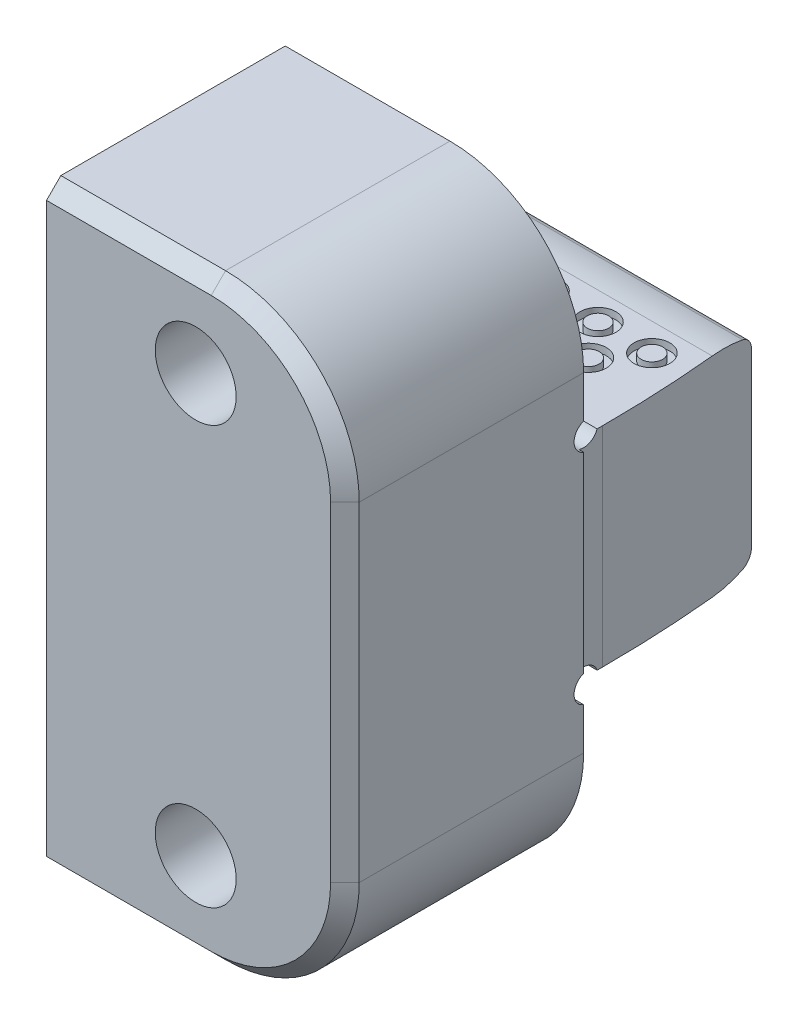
from build123d import *

# Parameters (mm, degrees)
EXTRUDE1_DEPTH        = 7.9375
SKETCH7_W             = 21.968267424
SKETCH7_H             = 31.720833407
CUT_EXTRUDE3_DEPTH    = 0.254
SKETCH8_R             = 0.762
CUT_EXTRUDE4_DEPTH    = 26.793821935
CUT_EXTRUDE5_DEPTH    = 26.793821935
CUT_EXTRUDE6_DEPTH    = 36.104934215
SKETCH15_R            = 0.9525
SKETCH15_R_2          = 0.5715
CUT_EXTRUDE7_DEPTH    = 0.381
F_6_CBORE_D           = 4.3053
F_6_CBORE_CBORE_D     = 7.14502
F_6_CBORE_CBORE_DEPTH = 4.29895
FILLET1_R             = 7.112
CHAMFER1_SIZE         = 0.762


with BuildPart() as part:
    # Sketch3 → Extrude1 (new, symmetric)
    with BuildSketch(Plane(origin=(0, 0, 0), x_dir=(0, 0, -1), z_dir=(1, 0, 0))):
        Polygon((-12.7, -15.875), (0, -15.875), (0, -5.56006), (9.7536, -5.56006), (9.7536, 5.56006), (0, 5.56006), (0, 15.875), (-12.7, 15.875), align=None)
    extrude(amount=EXTRUDE1_DEPTH, both=True)

    # Sketch7 → Cut-Extrude3 (cut)
    with BuildSketch(Plane(origin=(7.9375, 0, 0), x_dir=(0, 0, -1), z_dir=(1, 0, 0))):
        with Locations((10.984133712, 1.307835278)):
            Rectangle(SKETCH7_W, SKETCH7_H)
    extrude(amount=-CUT_EXTRUDE3_DEPTH, mode=Mode.SUBTRACT)

    # Sketch8 → Cut-Extrude4 (cut, through all)
    with BuildSketch(Plane(origin=(7.9375, 0, 0), x_dir=(0, 0, -1), z_dir=(1, 0, 0))):
        with Locations((0.254, 5.81406)):
            Circle(SKETCH8_R)
        with Locations((0.254, -5.81406)):
            Circle(SKETCH8_R)
    extrude(amount=-CUT_EXTRUDE4_DEPTH, mode=Mode.SUBTRACT)

    # Sketch9 → Cut-Extrude5 (cut, through all)
    with BuildSketch(Plane(origin=(7.9375, 0, 0), x_dir=(0, 0, -1), z_dir=(1, 0, 0))):
        with BuildLine():
            Line((9.7536, 4.564040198), (13.7414, 4.564040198))
            Line((13.7414, 4.564040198), (13.7414, 10.914040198))
            Line((13.7414, 10.914040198), (7.3914, 10.914040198))
            Line((7.3914, 10.914040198), (7.3914, 5.56006))
            ThreePointArc((7.3914, 5.56006), (8.31027584, 5.49322538), (9.209809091, 5.294128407))
            ThreePointArc((9.209809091, 5.294128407), (9.602713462, 5.019215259), (9.7536, 4.564040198))
        make_face()
        with BuildLine():
            Line((13.7414, -4.564040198), (13.7414, -10.914040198))
            Line((13.7414, -10.914040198), (7.3914, -10.914040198))
            Line((7.3914, -10.914040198), (7.3914, -5.56006))
            ThreePointArc((7.3914, -5.56006), (8.31027584, -5.49322538), (9.209809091, -5.294128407))
            ThreePointArc((9.209809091, -5.294128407), (9.602713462, -5.019215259), (9.7536, -4.564040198))
            Line((9.7536, -4.564040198), (13.7414, -4.564040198))
        make_face()
    extrude(amount=-CUT_EXTRUDE5_DEPTH, mode=Mode.SUBTRACT)

    # Sketch13 → Cut-Extrude6 (cut, through all)
    with BuildSketch(Plane(origin=(0, 15.875, 0), x_dir=(1, 0, 0), z_dir=(0, 1, 0))):
        with BuildLine():
            Line((6.400539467, 13.97), (19.100539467, 13.97))
            Line((19.100539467, 13.97), (19.100539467, 1.27))
            Line((19.100539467, 1.27), (7.6835, 1.27))
            ThreePointArc((7.6835, 1.27), (7.361945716, 7.652319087), (6.400539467, 13.97))
        make_face()
    extrude(amount=-CUT_EXTRUDE6_DEPTH, mode=Mode.SUBTRACT)

    # Sketch15 → Cut-Extrude7 (cut)
    # profile 1 of 9: a face of its own
    with BuildSketch(Plane(origin=(0, 5.56006, 0), x_dir=(1, 0, 0), z_dir=(0, 1, 0))):
        with Locations(Location((-2.9591, 5.9182, 0), (0, 0, 270))):
            Circle(SKETCH15_R)
        with Locations(Location((-2.9591, 5.9182, 0), (0, 0, 270))):
            Circle(SKETCH15_R_2, mode=Mode.SUBTRACT)
    # profile 2 of 9: a face of its own
    with BuildSketch(Plane(origin=(0, 5.56006, 0), x_dir=(1, 0, 0), z_dir=(0, 1, 0))):
        with Locations(Location((-0.0889, 5.9182, 0), (0, 0, 270))):
            Circle(SKETCH15_R)
        with Locations(Location((-0.0889, 5.9182, 0), (0, 0, 270))):
            Circle(SKETCH15_R_2, mode=Mode.SUBTRACT)
    # profile 3 of 9: a face of its own
    with BuildSketch(Plane(origin=(0, 5.56006, 0), x_dir=(1, 0, 0), z_dir=(0, 1, 0))):
        with Locations(Location((-5.8293, 5.9182, 0), (0, 0, 270))):
            Circle(SKETCH15_R)
        with Locations(Location((-5.8293, 5.9182, 0), (0, 0, 270))):
            Circle(SKETCH15_R_2, mode=Mode.SUBTRACT)
    # profile 4 of 9: a face of its own
    with BuildSketch(Plane(origin=(0, 5.56006, 0), x_dir=(1, 0, 0), z_dir=(0, 1, 0))):
        with Locations(Location((2.7813, 5.9182, 0), (0, 0, 270))):
            Circle(SKETCH15_R)
        with Locations(Location((2.7813, 5.9182, 0), (0, 0, 270))):
            Circle(SKETCH15_R_2, mode=Mode.SUBTRACT)
    # profile 5 of 9: a face of its own
    with BuildSketch(Plane(origin=(0, 5.56006, 0), x_dir=(1, 0, 0), z_dir=(0, 1, 0))):
        with Locations(Location((5.6515, 5.9182, 0), (0, 0, 270))):
            Circle(SKETCH15_R)
        with Locations(Location((5.6515, 5.9182, 0), (0, 0, 270))):
            Circle(SKETCH15_R_2, mode=Mode.SUBTRACT)
    # profile 6 of 9: a face of its own
    with BuildSketch(Plane(origin=(0, 5.56006, 0), x_dir=(1, 0, 0), z_dir=(0, 1, 0))):
        with Locations(Location((-1.5621, 4.0132, 0), (0, 0, 270))):
            Circle(SKETCH15_R)
        with Locations(Location((-1.5621, 4.0132, 0), (0, 0, 270))):
            Circle(SKETCH15_R_2, mode=Mode.SUBTRACT)
    # profile 7 of 9: a face of its own
    with BuildSketch(Plane(origin=(0, 5.56006, 0), x_dir=(1, 0, 0), z_dir=(0, 1, 0))):
        with Locations(Location((1.3081, 4.0132, 0), (0, 0, 270))):
            Circle(SKETCH15_R)
        with Locations(Location((1.3081, 4.0132, 0), (0, 0, 270))):
            Circle(SKETCH15_R_2, mode=Mode.SUBTRACT)
    # profile 8 of 9: a face of its own
    with BuildSketch(Plane(origin=(0, 5.56006, 0), x_dir=(1, 0, 0), z_dir=(0, 1, 0))):
        with Locations(Location((-4.4323, 4.0132, 0), (0, 0, 270))):
            Circle(SKETCH15_R)
        with Locations(Location((-4.4323, 4.0132, 0), (0, 0, 270))):
            Circle(SKETCH15_R_2, mode=Mode.SUBTRACT)
    # profile 9 of 9: a face of its own
    with BuildSketch(Plane(origin=(0, 5.56006, 0), x_dir=(1, 0, 0), z_dir=(0, 1, 0))):
        with Locations(Location((4.1783, 4.0132, 0), (0, 0, 270))):
            Circle(SKETCH15_R)
        with Locations(Location((4.1783, 4.0132, 0), (0, 0, 270))):
            Circle(SKETCH15_R_2, mode=Mode.SUBTRACT)
    cut_extrude7 = extrude(amount=-CUT_EXTRUDE7_DEPTH, mode=Mode.SUBTRACT)

    # Mirror1: Cut-Extrude7 across plane
    add(cut_extrude7.mirror(Plane.ZX), mode=Mode.SUBTRACT)

    # 6 CBORE (through all)
    with Locations(Plane(origin=(0, 0, 0), x_dir=(-1, 0, 0), z_dir=(0, 0, -1))):
        with Locations((0, 11.1125), (0, -11.1125)):
            CounterBoreHole(F_6_CBORE_D / 2, F_6_CBORE_CBORE_D / 2, F_6_CBORE_CBORE_DEPTH)

    # Fillet1
    fillet1_edges = [part.edges().sort_by_distance(p)[0] for p in [
        (7.9375, 15.875, 6.35),
        (7.9375, -15.875, 6.35),
    ]]
    fillet(fillet1_edges, radius=FILLET1_R)

    # Chamfer1
    chamfer1_edges = [part.edges().sort_by_distance(p)[0] for p in [
        (7.9375, 0, 12.7),
        (-3.556, -15.875, 12.7),
        (-3.556, 15.875, 12.7),
        (5.854443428, 13.791943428, 12.7),
        (5.854443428, -13.791943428, 12.7),
    ]]
    chamfer(chamfer1_edges, length=CHAMFER1_SIZE)


solid = part.part
